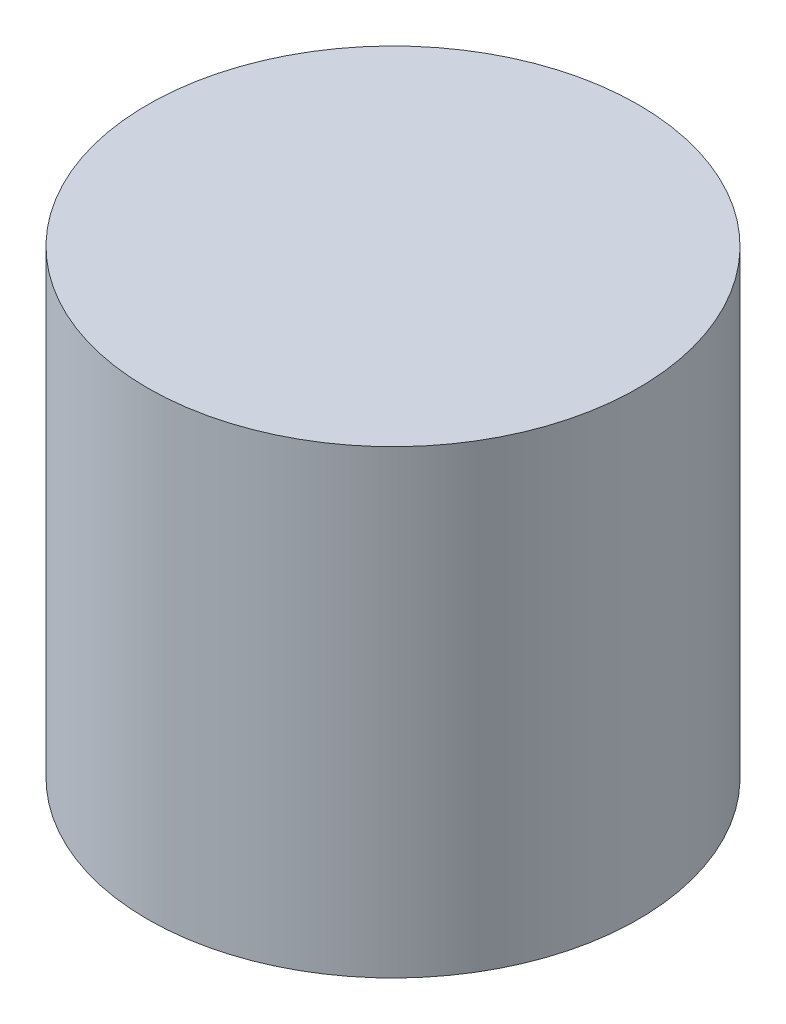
ISO-10303-21;
HEADER;
FILE_DESCRIPTION(('STEP AP214'),'2;1');
FILE_NAME('part.step','',(''),(''),'','','');
FILE_SCHEMA(('AUTOMOTIVE_DESIGN { 1 0 10303 214 1 1 1 1 }'));
ENDSEC;
DATA;
#1=APPLICATION_CONTEXT('core data for automotive mechanical design processes');
#2=APPLICATION_PROTOCOL_DEFINITION('international standard','automotive_design',2000,#1);
#3=PRODUCT_CONTEXT('',#1,'mechanical');
#4=PRODUCT('Part','Part','',(#3));
#5=PRODUCT_RELATED_PRODUCT_CATEGORY('part','',(#4));
#6=PRODUCT_DEFINITION_FORMATION('','',#4);
#7=PRODUCT_DEFINITION_CONTEXT('part definition',#1,'design');
#8=PRODUCT_DEFINITION('design','',#6,#7);
#9=PRODUCT_DEFINITION_SHAPE('','',#8);
#10=(LENGTH_UNIT() NAMED_UNIT(*) SI_UNIT(.MILLI.,.METRE.));
#11=(NAMED_UNIT(*) PLANE_ANGLE_UNIT() SI_UNIT($,.RADIAN.));
#12=(NAMED_UNIT(*) SI_UNIT($,.STERADIAN.) SOLID_ANGLE_UNIT());
#13=UNCERTAINTY_MEASURE_WITH_UNIT(LENGTH_MEASURE(1.E-05),#10,'distance_accuracy_value','');
#14=(GEOMETRIC_REPRESENTATION_CONTEXT(3) GLOBAL_UNCERTAINTY_ASSIGNED_CONTEXT((#13)) GLOBAL_UNIT_ASSIGNED_CONTEXT((#10,
#11,#12)) REPRESENTATION_CONTEXT('',''));
#15=CARTESIAN_POINT('',(0.,0.,0.));
#16=DIRECTION('',(0.,0.,1.));
#17=DIRECTION('',(1.,0.,0.));
#18=AXIS2_PLACEMENT_3D('',#15,#16,#17);
#19=CARTESIAN_POINT('',(0.,13.,0.));
#20=DIRECTION('',(0.,-1.,0.));
#21=DIRECTION('',(0.,0.,-1.));
#22=AXIS2_PLACEMENT_3D('',#19,#20,#21);
#23=PLANE('',#22);
#24=CARTESIAN_POINT('',(0.,13.,0.));
#25=DIRECTION('',(0.,-1.,0.));
#26=DIRECTION('',(0.,0.,-1.));
#27=AXIS2_PLACEMENT_3D('',#24,#25,#26);
#28=CIRCLE('',#27,4.);
#29=CARTESIAN_POINT('',(0.,13.,-4.));
#30=VERTEX_POINT('',#29);
#31=EDGE_CURVE('E10',#30,#30,#28,.T.);
#32=ORIENTED_EDGE('',*,*,#31,.T.);
#33=EDGE_LOOP('',(#32));
#34=FACE_BOUND('',#33,.T.);
#35=ADVANCED_FACE('F39',(#34),#23,.T.);
#36=CARTESIAN_POINT('',(0.,0.,0.));
#37=DIRECTION('',(0.,-1.,0.));
#38=DIRECTION('',(0.,0.,-1.));
#39=AXIS2_PLACEMENT_3D('',#36,#37,#38);
#40=CYLINDRICAL_SURFACE('',#39,4.);
#41=CARTESIAN_POINT('',(0.,0.,0.));
#42=DIRECTION('',(0.,-1.,0.));
#43=DIRECTION('',(0.,0.,-1.));
#44=AXIS2_PLACEMENT_3D('',#41,#42,#43);
#45=CIRCLE('',#44,4.);
#46=CARTESIAN_POINT('',(0.,0.,-4.));
#47=VERTEX_POINT('',#46);
#48=EDGE_CURVE('E46',#47,#47,#45,.T.);
#49=ORIENTED_EDGE('',*,*,#48,.T.);
#50=EDGE_LOOP('',(#49));
#51=FACE_BOUND('',#50,.T.);
#52=ORIENTED_EDGE('',*,*,#31,.F.);
#53=EDGE_LOOP('',(#52));
#54=FACE_BOUND('',#53,.T.);
#55=ADVANCED_FACE('F78',(#51,#54),#40,.F.);
#56=CARTESIAN_POINT('',(4.,0.,0.));
#57=DIRECTION('',(0.,-1.,0.));
#58=DIRECTION('',(0.,0.,-1.));
#59=AXIS2_PLACEMENT_3D('',#56,#57,#58);
#60=PLANE('',#59);
#61=CARTESIAN_POINT('',(0.,0.,0.));
#62=DIRECTION('',(0.,-1.,0.));
#63=DIRECTION('',(0.,0.,-1.));
#64=AXIS2_PLACEMENT_3D('',#61,#62,#63);
#65=CIRCLE('',#64,8.);
#66=CARTESIAN_POINT('',(0.,0.,-8.));
#67=VERTEX_POINT('',#66);
#68=EDGE_CURVE('E52',#67,#67,#65,.T.);
#69=ORIENTED_EDGE('',*,*,#68,.T.);
#70=EDGE_LOOP('',(#69));
#71=FACE_BOUND('',#70,.T.);
#72=ORIENTED_EDGE('',*,*,#48,.F.);
#73=EDGE_LOOP('',(#72));
#74=FACE_BOUND('',#73,.T.);
#75=ADVANCED_FACE('F75',(#71,#74),#60,.T.);
#76=CARTESIAN_POINT('',(0.,0.,0.));
#77=DIRECTION('',(0.,-1.,0.));
#78=DIRECTION('',(0.,0.,-1.));
#79=AXIS2_PLACEMENT_3D('',#76,#77,#78);
#80=CYLINDRICAL_SURFACE('',#79,8.);
#81=CARTESIAN_POINT('',(0.,15.,0.));
#82=DIRECTION('',(0.,-1.,0.));
#83=DIRECTION('',(0.,0.,-1.));
#84=AXIS2_PLACEMENT_3D('',#81,#82,#83);
#85=CIRCLE('',#84,7.99999999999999);
#86=CARTESIAN_POINT('',(0.,15.,-7.99999999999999));
#87=VERTEX_POINT('',#86);
#88=EDGE_CURVE('E58',#87,#87,#85,.T.);
#89=ORIENTED_EDGE('',*,*,#88,.T.);
#90=EDGE_LOOP('',(#89));
#91=FACE_BOUND('',#90,.T.);
#92=ORIENTED_EDGE('',*,*,#68,.F.);
#93=EDGE_LOOP('',(#92));
#94=FACE_BOUND('',#93,.T.);
#95=ADVANCED_FACE('F66',(#91,#94),#80,.T.);
#96=CARTESIAN_POINT('',(7.99999999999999,15.,0.));
#97=DIRECTION('',(0.,1.,0.));
#98=DIRECTION('',(0.,0.,1.));
#99=AXIS2_PLACEMENT_3D('',#96,#97,#98);
#100=PLANE('',#99);
#101=ORIENTED_EDGE('',*,*,#88,.F.);
#102=EDGE_LOOP('',(#101));
#103=FACE_BOUND('',#102,.T.);
#104=ADVANCED_FACE('F69',(#103),#100,.T.);
#105=CLOSED_SHELL('',(#35,#55,#75,#95,#104));
#106=MANIFOLD_SOLID_BREP('B2',#105);
#107=ADVANCED_BREP_SHAPE_REPRESENTATION('',(#18,#106),#14);
#108=SHAPE_DEFINITION_REPRESENTATION(#9,#107);
ENDSEC;
END-ISO-10303-21;
